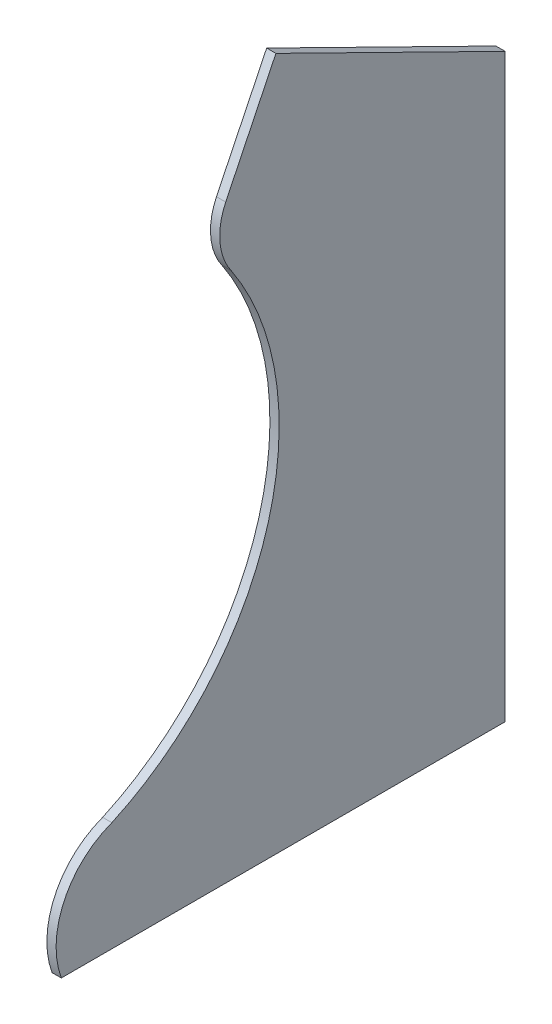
from build123d import *

# Parameters (mm, degrees)
BOSS_EXTRU_1_DEPTH      = 10
ESQUISSE5_R             = 66.434100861
ENL_V_MAT_EXTRU_2_DEPTH = 10


with BuildPart() as part:
    # Esquisse2 → Boss.-Extru.1 (new body)
    with BuildSketch(Plane(origin=(0, 0, 0), x_dir=(0, 0, -1), z_dir=(1, 0, 0))):
        with BuildLine():
            Line((62.11144606, -17.556283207), (7.755938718, -129.765163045))
            ThreePointArc((7.755938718, -129.765163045), (1.547407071, -164.270911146), (13.773197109, -197.13004344))
            ThreePointArc((13.773197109, -197.13004344), (53.757211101, -453.432473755), (-115.46976515, -650.033307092))
            ThreePointArc((-115.46976515, -650.033307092), (-167.336387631, -697.841176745), (-170.20635928, -768.321686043))
            Line((-170.20635928, -768.321686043), (310.28364072, -768.321686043))
            Line((310.28364072, -768.321686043), (310.28364072, -139.724382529))
            Line((310.28364072, -139.724382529), (62.11144606, -17.556283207))
        make_face()
    extrude(amount=BOSS_EXTRU_1_DEPTH)

    # Esquisse5 → Enl_v. mat.-Extru.2 (cut)
    with BuildSketch(Plane.ZY):
        with Locations((-961.779859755, -372.095858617)):
            Circle(ESQUISSE5_R)
    extrude(amount=-ENL_V_MAT_EXTRU_2_DEPTH, mode=Mode.SUBTRACT)


solid = part.part
